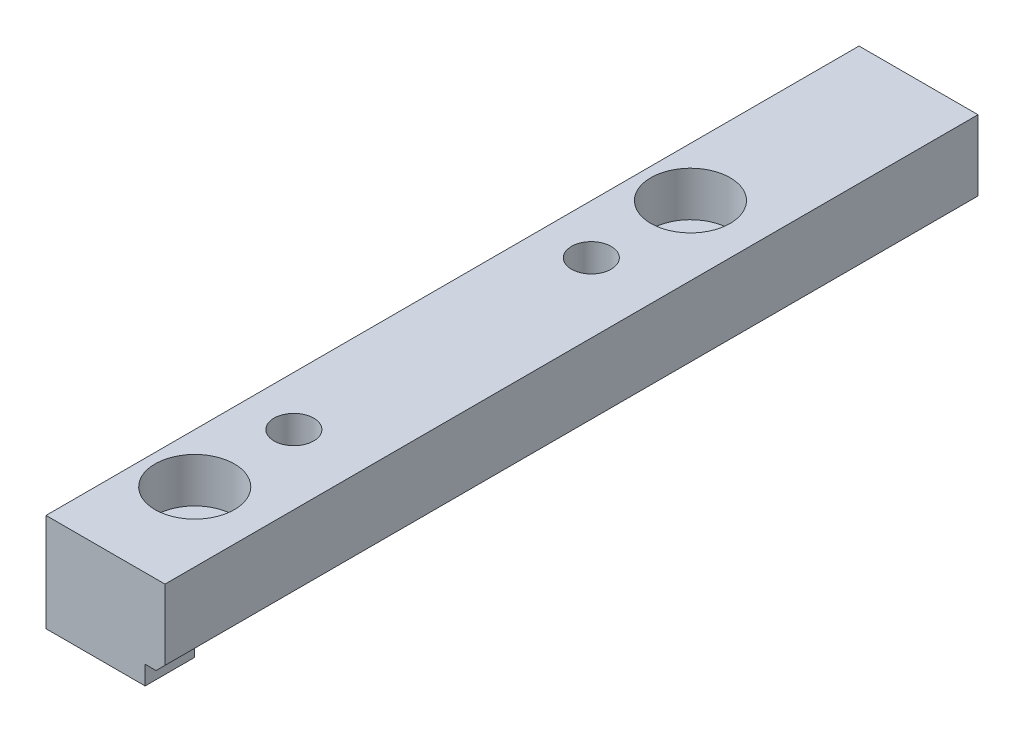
from build123d import *

# Parameters (mm, degrees)
EXTRUDE_1_DEPTH     = 82
SKETCH_2_OUTSIDE_W  = 100.692
SKETCH_2_OUTSIDE_H  = 28.592
CUT_EXTRUDE_1_DEPTH = 82
SKETCH_3_R          = 2.25
CUT_EXTRUDE_2_DEPTH = 82
SKETCH_4_R          = 4
CUT_EXTRUDE_3_DEPTH = 4.5
SKETCH_5_R          = 2
CUT_EXTRUDE_4_DEPTH = 84.462626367


with BuildPart() as part:
    # Sketch 1 → Extrude 1 (new body)
    with BuildSketch(Plane.XY):
        Polygon((0, 0), (0, 9.9), (12, 9.9), (12, 2.8), (11.1, 1.9), (10, 1.9), (10, 0), align=None)
    extrude(amount=EXTRUDE_1_DEPTH)

    # Sketch 2 outside → Cut-Extrude 1 (cut)
    with BuildSketch(Plane(origin=(12, 0, 0), x_dir=(0, 0, -1), z_dir=(1, 0, 0))):
        with Locations((-41, 4.95)):
            Rectangle(SKETCH_2_OUTSIDE_W, SKETCH_2_OUTSIDE_H)
        Polygon((-77, 1.9), (0, 1.9), (0, 9.9), (-82, 9.9), (-82, 0), (-77, 0), align=None, mode=Mode.SUBTRACT)
    extrude(amount=-CUT_EXTRUDE_1_DEPTH, mode=Mode.SUBTRACT)

    # Sketch 3 → Cut-Extrude 2 (cut)
    with BuildSketch(Plane(origin=(0, 9.9, 0), x_dir=(1, 0, 0), z_dir=(0, 1, 0))):
        with Locations(Location((5, -22, 0), (0, 0, 270))):
            Circle(SKETCH_3_R)
        with Locations(Location((5, -72, 0), (0, 0, 270))):
            Circle(SKETCH_3_R)
    extrude(amount=-CUT_EXTRUDE_2_DEPTH, mode=Mode.SUBTRACT)

    # Sketch 4 → Cut-Extrude 3 (cut)
    with BuildSketch(Plane(origin=(0, 9.9, 0), x_dir=(1, 0, 0), z_dir=(0, 1, 0))):
        with Locations(Location((5, -22, 0), (0, 0, 270))):
            Circle(SKETCH_4_R)
        with Locations(Location((5, -72, 0), (0, 0, 270))):
            Circle(SKETCH_4_R)
    extrude(amount=-CUT_EXTRUDE_3_DEPTH, mode=Mode.SUBTRACT)

    # Sketch 5 → Cut-Extrude 4 (cut, through all)
    with BuildSketch(Plane(origin=(0, 9.9, 0), x_dir=(1, 0, 0), z_dir=(0, 1, 0))):
        with Locations(Location((5, -32, 0), (0, 0, 270))):
            Circle(SKETCH_5_R)
        with Locations(Location((5, -62, 0), (0, 0, 270))):
            Circle(SKETCH_5_R)
    extrude(amount=-CUT_EXTRUDE_4_DEPTH, mode=Mode.SUBTRACT)


solid = part.part
